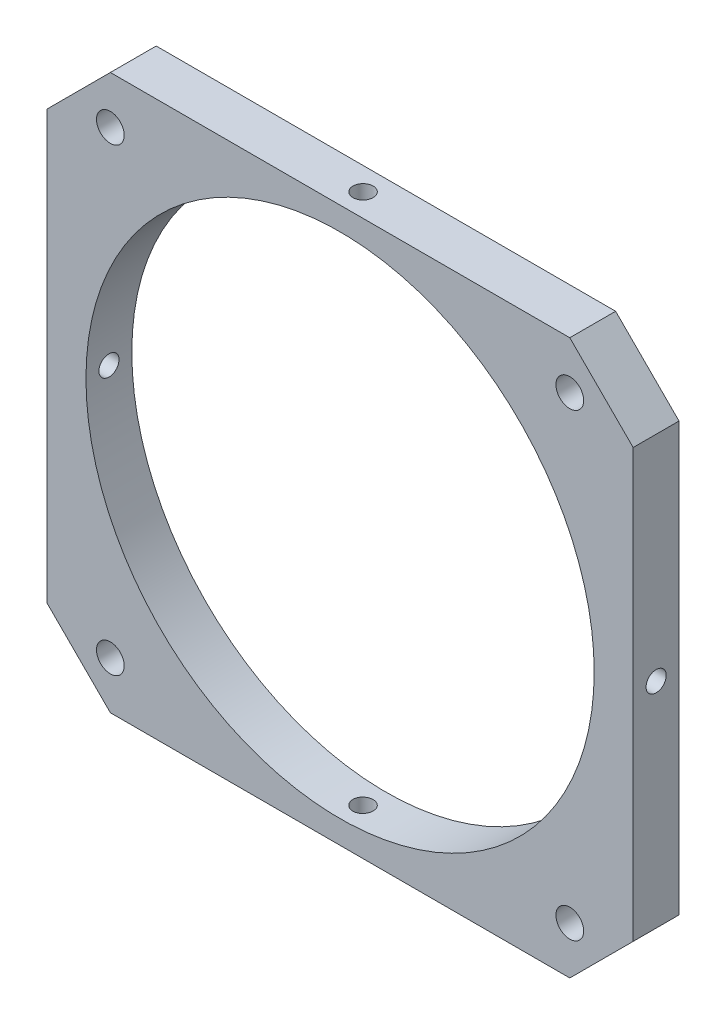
ISO-10303-21;
HEADER;
FILE_DESCRIPTION(('STEP AP214'),'2;1');
FILE_NAME('part.step','',(''),(''),'','','');
FILE_SCHEMA(('AUTOMOTIVE_DESIGN { 1 0 10303 214 1 1 1 1 }'));
ENDSEC;
DATA;
#1=APPLICATION_CONTEXT('core data for automotive mechanical design processes');
#2=APPLICATION_PROTOCOL_DEFINITION('international standard','automotive_design',2000,#1);
#3=PRODUCT_CONTEXT('',#1,'mechanical');
#4=PRODUCT('Part','Part','',(#3));
#5=PRODUCT_RELATED_PRODUCT_CATEGORY('part','',(#4));
#6=PRODUCT_DEFINITION_FORMATION('','',#4);
#7=PRODUCT_DEFINITION_CONTEXT('part definition',#1,'design');
#8=PRODUCT_DEFINITION('design','',#6,#7);
#9=PRODUCT_DEFINITION_SHAPE('','',#8);
#10=(LENGTH_UNIT() NAMED_UNIT(*) SI_UNIT(.MILLI.,.METRE.));
#11=(NAMED_UNIT(*) PLANE_ANGLE_UNIT() SI_UNIT($,.RADIAN.));
#12=(NAMED_UNIT(*) SI_UNIT($,.STERADIAN.) SOLID_ANGLE_UNIT());
#13=UNCERTAINTY_MEASURE_WITH_UNIT(LENGTH_MEASURE(1.E-05),#10,'distance_accuracy_value','');
#14=(GEOMETRIC_REPRESENTATION_CONTEXT(3) GLOBAL_UNCERTAINTY_ASSIGNED_CONTEXT((#13)) GLOBAL_UNIT_ASSIGNED_CONTEXT((#10,
#11,#12)) REPRESENTATION_CONTEXT('',''));
#15=CARTESIAN_POINT('',(0.,0.,0.));
#16=DIRECTION('',(0.,0.,1.));
#17=DIRECTION('',(1.,0.,0.));
#18=AXIS2_PLACEMENT_3D('',#15,#16,#17);
#19=CARTESIAN_POINT('',(-46.0375,-55.5625,19.05));
#20=DIRECTION('',(0.,1.,0.));
#21=DIRECTION('',(0.,0.,1.));
#22=AXIS2_PLACEMENT_3D('',#19,#20,#21);
#23=PLANE('',#22);
#24=CARTESIAN_POINT('',(-2.64090887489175E-13,-55.5625,14.4455300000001));
#25=DIRECTION('',(0.,1.,0.));
#26=DIRECTION('',(0.,0.,1.));
#27=AXIS2_PLACEMENT_3D('',#24,#25,#26);
#28=CIRCLE('',#27,2.01929999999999);
#29=CARTESIAN_POINT('',(-2.64090887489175E-13,-55.5625,16.4648300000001));
#30=VERTEX_POINT('',#29);
#31=EDGE_CURVE('E261',#30,#30,#28,.T.);
#32=ORIENTED_EDGE('',*,*,#31,.T.);
#33=EDGE_LOOP('',(#32));
#34=FACE_BOUND('',#33,.T.);
#35=DIRECTION('',(0.,0.,-1.));
#36=VECTOR('',#35,1.);
#37=CARTESIAN_POINT('',(-46.0375,-55.5625,19.05));
#38=LINE('',#37,#36);
#39=CARTESIAN_POINT('',(-46.0375,-55.5625,19.05));
#40=VERTEX_POINT('',#39);
#41=CARTESIAN_POINT('',(-46.0375,-55.5625,9.86155));
#42=VERTEX_POINT('',#41);
#43=EDGE_CURVE('E11',#40,#42,#38,.T.);
#44=ORIENTED_EDGE('',*,*,#43,.T.);
#45=DIRECTION('',(-1.,0.,0.));
#46=VECTOR('',#45,1.);
#47=CARTESIAN_POINT('',(46.0375,-55.5625,9.86155));
#48=LINE('',#47,#46);
#49=CARTESIAN_POINT('',(46.0375,-55.5625,9.86155));
#50=VERTEX_POINT('',#49);
#51=EDGE_CURVE('E152',#50,#42,#48,.T.);
#52=ORIENTED_EDGE('',*,*,#51,.F.);
#53=DIRECTION('',(0.,0.,-1.));
#54=VECTOR('',#53,1.);
#55=CARTESIAN_POINT('',(46.0375,-55.5625,19.05));
#56=LINE('',#55,#54);
#57=CARTESIAN_POINT('',(46.0375,-55.5625,19.05));
#58=VERTEX_POINT('',#57);
#59=EDGE_CURVE('E57',#58,#50,#56,.T.);
#60=ORIENTED_EDGE('',*,*,#59,.F.);
#61=DIRECTION('',(1.,0.,0.));
#62=VECTOR('',#61,1.);
#63=CARTESIAN_POINT('',(-46.0375,-55.5625,19.05));
#64=LINE('',#63,#62);
#65=EDGE_CURVE('E272',#40,#58,#64,.T.);
#66=ORIENTED_EDGE('',*,*,#65,.F.);
#67=EDGE_LOOP('',(#44,#52,#60,#66));
#68=FACE_BOUND('',#67,.T.);
#69=ADVANCED_FACE('F44',(#34,#68),#23,.F.);
#70=CARTESIAN_POINT('',(58.7375,42.8625,19.05));
#71=DIRECTION('',(-1.,0.,0.));
#72=DIRECTION('',(0.,-1.,0.));
#73=AXIS2_PLACEMENT_3D('',#70,#71,#72);
#74=PLANE('',#73);
#75=CARTESIAN_POINT('',(58.7375,0.,14.4455300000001));
#76=DIRECTION('',(-1.,0.,0.));
#77=DIRECTION('',(0.,0.,1.));
#78=AXIS2_PLACEMENT_3D('',#75,#76,#77);
#79=CIRCLE('',#78,2.01929999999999);
#80=CARTESIAN_POINT('',(58.7375,0.,16.4648300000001));
#81=VERTEX_POINT('',#80);
#82=EDGE_CURVE('E264',#81,#81,#79,.T.);
#83=ORIENTED_EDGE('',*,*,#82,.T.);
#84=EDGE_LOOP('',(#83));
#85=FACE_BOUND('',#84,.T.);
#86=DIRECTION('',(0.,0.,-1.));
#87=VECTOR('',#86,1.);
#88=CARTESIAN_POINT('',(58.7375,-42.8625,19.05));
#89=LINE('',#88,#87);
#90=CARTESIAN_POINT('',(58.7375,-42.8625,19.05));
#91=VERTEX_POINT('',#90);
#92=CARTESIAN_POINT('',(58.7375,-42.8625,9.86155));
#93=VERTEX_POINT('',#92);
#94=EDGE_CURVE('E290',#91,#93,#89,.T.);
#95=ORIENTED_EDGE('',*,*,#94,.T.);
#96=DIRECTION('',(0.,-1.,0.));
#97=VECTOR('',#96,1.);
#98=CARTESIAN_POINT('',(58.7375,42.8625,9.86155));
#99=LINE('',#98,#97);
#100=CARTESIAN_POINT('',(58.7375,42.8625,9.86155));
#101=VERTEX_POINT('',#100);
#102=EDGE_CURVE('E146',#101,#93,#99,.T.);
#103=ORIENTED_EDGE('',*,*,#102,.F.);
#104=DIRECTION('',(0.,0.,-1.));
#105=VECTOR('',#104,1.);
#106=CARTESIAN_POINT('',(58.7375,42.8625,19.05));
#107=LINE('',#106,#105);
#108=CARTESIAN_POINT('',(58.7375,42.8625,19.05));
#109=VERTEX_POINT('',#108);
#110=EDGE_CURVE('E288',#109,#101,#107,.T.);
#111=ORIENTED_EDGE('',*,*,#110,.F.);
#112=DIRECTION('',(0.,1.,0.));
#113=VECTOR('',#112,1.);
#114=CARTESIAN_POINT('',(58.7375,42.8625,19.05));
#115=LINE('',#114,#113);
#116=EDGE_CURVE('E276',#91,#109,#115,.T.);
#117=ORIENTED_EDGE('',*,*,#116,.F.);
#118=EDGE_LOOP('',(#95,#103,#111,#117));
#119=FACE_BOUND('',#118,.T.);
#120=ADVANCED_FACE('F211',(#85,#119),#74,.F.);
#121=CARTESIAN_POINT('',(-46.0375,55.5625,19.05));
#122=DIRECTION('',(0.,-1.,0.));
#123=DIRECTION('',(0.,0.,-1.));
#124=AXIS2_PLACEMENT_3D('',#121,#122,#123);
#125=PLANE('',#124);
#126=CARTESIAN_POINT('',(6.52081751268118E-13,55.5625,14.4455300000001));
#127=DIRECTION('',(0.,-1.,0.));
#128=DIRECTION('',(0.,0.,-1.));
#129=AXIS2_PLACEMENT_3D('',#126,#127,#128);
#130=CIRCLE('',#129,2.01929999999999);
#131=CARTESIAN_POINT('',(6.52081751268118E-13,55.5625,12.4262300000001));
#132=VERTEX_POINT('',#131);
#133=EDGE_CURVE('E177',#132,#132,#130,.T.);
#134=ORIENTED_EDGE('',*,*,#133,.T.);
#135=EDGE_LOOP('',(#134));
#136=FACE_BOUND('',#135,.T.);
#137=DIRECTION('',(0.,0.,-1.));
#138=VECTOR('',#137,1.);
#139=CARTESIAN_POINT('',(46.0375,55.5625,19.05));
#140=LINE('',#139,#138);
#141=CARTESIAN_POINT('',(46.0375,55.5625,19.05));
#142=VERTEX_POINT('',#141);
#143=CARTESIAN_POINT('',(46.0375,55.5625,9.86155));
#144=VERTEX_POINT('',#143);
#145=EDGE_CURVE('E120',#142,#144,#140,.T.);
#146=ORIENTED_EDGE('',*,*,#145,.T.);
#147=DIRECTION('',(1.,0.,0.));
#148=VECTOR('',#147,1.);
#149=CARTESIAN_POINT('',(-46.0375,55.5625,9.86155));
#150=LINE('',#149,#148);
#151=CARTESIAN_POINT('',(-46.0375,55.5625,9.86155));
#152=VERTEX_POINT('',#151);
#153=EDGE_CURVE('E124',#152,#144,#150,.T.);
#154=ORIENTED_EDGE('',*,*,#153,.F.);
#155=DIRECTION('',(0.,0.,-1.));
#156=VECTOR('',#155,1.);
#157=CARTESIAN_POINT('',(-46.0375,55.5625,19.05));
#158=LINE('',#157,#156);
#159=CARTESIAN_POINT('',(-46.0375,55.5625,19.05));
#160=VERTEX_POINT('',#159);
#161=EDGE_CURVE('E113',#160,#152,#158,.T.);
#162=ORIENTED_EDGE('',*,*,#161,.F.);
#163=DIRECTION('',(-1.,0.,0.));
#164=VECTOR('',#163,1.);
#165=CARTESIAN_POINT('',(-46.0375,55.5625,19.05));
#166=LINE('',#165,#164);
#167=EDGE_CURVE('E280',#142,#160,#166,.T.);
#168=ORIENTED_EDGE('',*,*,#167,.F.);
#169=EDGE_LOOP('',(#146,#154,#162,#168));
#170=FACE_BOUND('',#169,.T.);
#171=ADVANCED_FACE('F125',(#136,#170),#125,.F.);
#172=CARTESIAN_POINT('',(-58.7375,42.8625,19.05));
#173=DIRECTION('',(1.,0.,0.));
#174=DIRECTION('',(0.,1.,0.));
#175=AXIS2_PLACEMENT_3D('',#172,#173,#174);
#176=PLANE('',#175);
#177=CARTESIAN_POINT('',(-58.7375,0.,14.4455300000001));
#178=DIRECTION('',(1.,0.,0.));
#179=DIRECTION('',(0.,0.,1.));
#180=AXIS2_PLACEMENT_3D('',#177,#178,#179);
#181=CIRCLE('',#180,2.01929999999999);
#182=CARTESIAN_POINT('',(-58.7375,0.,16.4648300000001));
#183=VERTEX_POINT('',#182);
#184=EDGE_CURVE('E262',#183,#183,#181,.T.);
#185=ORIENTED_EDGE('',*,*,#184,.T.);
#186=EDGE_LOOP('',(#185));
#187=FACE_BOUND('',#186,.T.);
#188=DIRECTION('',(0.,0.,-1.));
#189=VECTOR('',#188,1.);
#190=CARTESIAN_POINT('',(-58.7375,42.8625,19.05));
#191=LINE('',#190,#189);
#192=CARTESIAN_POINT('',(-58.7375,42.8625,19.05));
#193=VERTEX_POINT('',#192);
#194=CARTESIAN_POINT('',(-58.7375,42.8625,9.86155));
#195=VERTEX_POINT('',#194);
#196=EDGE_CURVE('E121',#193,#195,#191,.T.);
#197=ORIENTED_EDGE('',*,*,#196,.T.);
#198=DIRECTION('',(0.,1.,0.));
#199=VECTOR('',#198,1.);
#200=CARTESIAN_POINT('',(-58.7375,-42.8625,9.86155));
#201=LINE('',#200,#199);
#202=CARTESIAN_POINT('',(-58.7375,-42.8625,9.86155));
#203=VERTEX_POINT('',#202);
#204=EDGE_CURVE('E137',#203,#195,#201,.T.);
#205=ORIENTED_EDGE('',*,*,#204,.F.);
#206=DIRECTION('',(0.,0.,-1.));
#207=VECTOR('',#206,1.);
#208=CARTESIAN_POINT('',(-58.7375,-42.8625,19.05));
#209=LINE('',#208,#207);
#210=CARTESIAN_POINT('',(-58.7375,-42.8625,19.05));
#211=VERTEX_POINT('',#210);
#212=EDGE_CURVE('E284',#211,#203,#209,.T.);
#213=ORIENTED_EDGE('',*,*,#212,.F.);
#214=DIRECTION('',(0.,-1.,0.));
#215=VECTOR('',#214,1.);
#216=CARTESIAN_POINT('',(-58.7375,42.8625,19.05));
#217=LINE('',#216,#215);
#218=EDGE_CURVE('E64',#193,#211,#217,.T.);
#219=ORIENTED_EDGE('',*,*,#218,.F.);
#220=EDGE_LOOP('',(#197,#205,#213,#219));
#221=FACE_BOUND('',#220,.T.);
#222=ADVANCED_FACE('F231',(#187,#221),#176,.F.);
#223=CARTESIAN_POINT('',(0.,0.,19.05));
#224=DIRECTION('',(0.,0.,-1.));
#225=DIRECTION('',(-1.,0.,0.));
#226=AXIS2_PLACEMENT_3D('',#223,#224,#225);
#227=CYLINDRICAL_SURFACE('',#226,50.927);
#228=CARTESIAN_POINT('',(0.,0.,19.05));
#229=DIRECTION('',(0.,0.,1.));
#230=DIRECTION('',(1.,0.,0.));
#231=AXIS2_PLACEMENT_3D('',#228,#229,#230);
#232=CIRCLE('',#231,50.927);
#233=CARTESIAN_POINT('',(50.927,0.,19.05));
#234=VERTEX_POINT('',#233);
#235=EDGE_CURVE('E267',#234,#234,#232,.T.);
#236=ORIENTED_EDGE('',*,*,#235,.T.);
#237=EDGE_LOOP('',(#236));
#238=FACE_BOUND('',#237,.T.);
#239=CARTESIAN_POINT('',(50.927,0.,16.4648300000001));
#240=CARTESIAN_POINT('',(50.9269994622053,0.113377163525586,16.4648249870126));
#241=CARTESIAN_POINT('',(50.9266173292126,0.226835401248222,16.4552492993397));
#242=CARTESIAN_POINT('',(50.925129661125,0.450623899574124,16.4171846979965));
#243=CARTESIAN_POINT('',(50.924023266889,0.560950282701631,16.3886733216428));
#244=CARTESIAN_POINT('',(50.9212123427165,0.775200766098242,16.3135532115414));
#245=CARTESIAN_POINT('',(50.9195081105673,0.879128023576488,16.2669534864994));
#246=CARTESIAN_POINT('',(50.91569361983,1.07765620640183,16.1569927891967));
#247=CARTESIAN_POINT('',(50.9135834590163,1.17225936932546,16.0936358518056));
#248=CARTESIAN_POINT('',(50.9091929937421,1.3495478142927,15.9519096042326));
#249=CARTESIAN_POINT('',(50.9069125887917,1.43222597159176,15.8735313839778));
#250=CARTESIAN_POINT('',(50.9024395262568,1.58325706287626,15.7040043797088));
#251=CARTESIAN_POINT('',(50.9002468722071,1.65160942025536,15.6128550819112));
#252=CARTESIAN_POINT('',(50.8961959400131,1.7720650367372,15.4203401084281));
#253=CARTESIAN_POINT('',(50.894337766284,1.82416322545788,15.3189712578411));
#254=CARTESIAN_POINT('',(50.8911664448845,1.91059894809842,15.1089171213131));
#255=CARTESIAN_POINT('',(50.8898532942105,1.94493657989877,15.0002318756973));
#256=CARTESIAN_POINT('',(50.8879209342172,1.99485898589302,14.7786912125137));
#257=CARTESIAN_POINT('',(50.8873013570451,2.01045370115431,14.6658380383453));
#258=CARTESIAN_POINT('',(50.886824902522,2.02247824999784,14.4391140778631));
#259=CARTESIAN_POINT('',(50.8869680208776,2.01890819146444,14.3252432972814));
#260=CARTESIAN_POINT('',(50.8880004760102,1.99271286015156,14.099783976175));
#261=CARTESIAN_POINT('',(50.8888893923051,1.97009832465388,13.9881941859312));
#262=CARTESIAN_POINT('',(50.8913125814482,1.90647260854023,13.7703960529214));
#263=CARTESIAN_POINT('',(50.8928468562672,1.86546137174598,13.66418772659));
#264=CARTESIAN_POINT('',(50.89638830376,1.76619410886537,13.4601327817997));
#265=CARTESIAN_POINT('',(50.8983956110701,1.7079331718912,13.3622885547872));
#266=CARTESIAN_POINT('',(50.902656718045,1.57582392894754,13.17776543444));
#267=CARTESIAN_POINT('',(50.9049105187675,1.50197555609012,13.0910865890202));
#268=CARTESIAN_POINT('',(50.9094124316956,1.34072705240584,12.931292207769));
#269=CARTESIAN_POINT('',(50.9116605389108,1.25331761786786,12.8581860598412));
#270=CARTESIAN_POINT('',(50.9158961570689,1.06746098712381,12.7276845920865));
#271=CARTESIAN_POINT('',(50.9178836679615,0.969013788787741,12.6702892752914));
#272=CARTESIAN_POINT('',(50.9213741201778,0.763870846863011,12.572839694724));
#273=CARTESIAN_POINT('',(50.9228770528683,0.657174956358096,12.5327857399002));
#274=CARTESIAN_POINT('',(50.9252288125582,0.438565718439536,12.4711619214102));
#275=CARTESIAN_POINT('',(50.9260776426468,0.326652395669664,12.4495919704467));
#276=CARTESIAN_POINT('',(50.9270251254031,0.100866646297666,12.4255599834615));
#277=CARTESIAN_POINT('',(50.9271242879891,-0.013004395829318,12.4230849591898));
#278=CARTESIAN_POINT('',(50.9265626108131,-0.239544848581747,12.4372792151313));
#279=CARTESIAN_POINT('',(50.9259017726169,-0.352214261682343,12.453948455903));
#280=CARTESIAN_POINT('',(50.9238948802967,-0.57311689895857,12.5059473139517));
#281=CARTESIAN_POINT('',(50.9225490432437,-0.681351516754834,12.5412710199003));
#282=CARTESIAN_POINT('',(50.9193237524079,-0.890355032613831,12.6295701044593));
#283=CARTESIAN_POINT('',(50.9174442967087,-0.991123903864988,12.6825455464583));
#284=CARTESIAN_POINT('',(50.9133620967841,-1.18239519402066,12.8046776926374));
#285=CARTESIAN_POINT('',(50.9111591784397,-1.27289203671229,12.8738431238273));
#286=CARTESIAN_POINT('',(50.9066788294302,-1.44099436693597,13.026379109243));
#287=CARTESIAN_POINT('',(50.9044013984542,-1.51859980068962,13.109749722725));
#288=CARTESIAN_POINT('',(50.9000272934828,-1.6587599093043,13.2883852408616));
#289=CARTESIAN_POINT('',(50.8979307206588,-1.72130619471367,13.3836567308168));
#290=CARTESIAN_POINT('',(50.8941563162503,-1.82951521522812,13.5833561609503));
#291=CARTESIAN_POINT('',(50.8924784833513,-1.87517800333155,13.6877840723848));
#292=CARTESIAN_POINT('',(50.8897314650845,-1.94830914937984,13.9028006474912));
#293=CARTESIAN_POINT('',(50.8886620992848,-1.97578290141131,14.0133874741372));
#294=CARTESIAN_POINT('',(50.8872520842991,-2.01177375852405,14.2376085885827));
#295=CARTESIAN_POINT('',(50.8869114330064,-2.02029091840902,14.3512428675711));
#296=CARTESIAN_POINT('',(50.8869973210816,-2.01812621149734,14.5782495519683));
#297=CARTESIAN_POINT('',(50.887423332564,-2.00745755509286,14.6916220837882));
#298=CARTESIAN_POINT('',(50.8889934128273,-1.96725130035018,14.9149653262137));
#299=CARTESIAN_POINT('',(50.8901374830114,-1.93771366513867,15.0249360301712));
#300=CARTESIAN_POINT('',(50.8930146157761,-1.8606102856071,15.2383575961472));
#301=CARTESIAN_POINT('',(50.894747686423,-1.81304429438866,15.3418083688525));
#302=CARTESIAN_POINT('',(50.8986073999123,-1.70123746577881,15.5392550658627));
#303=CARTESIAN_POINT('',(50.9007340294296,-1.6369971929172,15.6332513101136));
#304=CARTESIAN_POINT('',(50.9051427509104,-1.49362079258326,15.8091849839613));
#305=CARTESIAN_POINT('',(50.9074249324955,-1.41447603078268,15.891115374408));
#306=CARTESIAN_POINT('',(50.9118871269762,-1.243532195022,16.0405501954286));
#307=CARTESIAN_POINT('',(50.914067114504,-1.15173000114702,16.1080510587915));
#308=CARTESIAN_POINT('',(50.9180802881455,-0.958026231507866,16.2267305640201));
#309=CARTESIAN_POINT('',(50.9199132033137,-0.856116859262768,16.277896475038));
#310=CARTESIAN_POINT('',(50.9230212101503,-0.645224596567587,16.362331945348));
#311=CARTESIAN_POINT('',(50.9242969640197,-0.536250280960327,16.3956227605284));
#312=CARTESIAN_POINT('',(50.925807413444,-0.355493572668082,16.4345784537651));
#313=CARTESIAN_POINT('',(50.9262526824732,-0.284883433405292,16.4459084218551));
#314=CARTESIAN_POINT('',(50.9268491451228,-0.142859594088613,16.4610357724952));
#315=CARTESIAN_POINT('',(50.9270003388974,-0.0714458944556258,16.4648331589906));
#316=CARTESIAN_POINT('',(50.927,0.,16.4648300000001));
#317=B_SPLINE_CURVE_WITH_KNOTS('',3,(#239,#240,#241,#242,#243,#244,#245,#246,#247,#248,#249,
#250,#251,#252,#253,#254,#255,#256,#257,#258,#259,#260,#261,#262,#263,#264,#265,#266,#267,#268,
#269,#270,#271,#272,#273,#274,#275,#276,#277,#278,#279,#280,#281,#282,#283,#284,#285,#286,#287,
#288,#289,#290,#291,#292,#293,#294,#295,#296,#297,#298,#299,#300,#301,#302,#303,#304,#305,#306,
#307,#308,#309,#310,#311,#312,#313,#314,#315,#316),.UNSPECIFIED.,.T.,.F.,(4,2,2,2,2,2,2,2,2,2,2,
2,2,2,2,2,2,2,2,2,2,2,2,2,2,2,2,2,2,2,2,2,2,2,2,2,2,2,4),(0.,0.33987069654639,0.680145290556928,
1.02025063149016,1.36027415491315,1.70049999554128,2.04073952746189,2.38108508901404,
2.7214287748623,3.06159186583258,3.40175304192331,3.74172256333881,4.08169312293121,
4.42176056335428,4.76182946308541,5.1021327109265,5.44243602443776,5.78274540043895,
6.12305316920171,6.46312944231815,6.80320501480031,7.14317288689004,7.48314197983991,
7.82329475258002,8.16344894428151,8.50379219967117,8.84413438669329,9.18437559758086,
9.52461582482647,9.86462186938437,10.2046285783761,10.5446399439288,10.8846397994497,
11.2248372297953,11.5651186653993,11.9056646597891,12.2458047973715,12.4599782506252,
12.674151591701),.UNSPECIFIED.);
#318=CARTESIAN_POINT('',(50.927,0.,16.4648300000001));
#319=VERTEX_POINT('',#318);
#320=EDGE_CURVE('E48',#319,#319,#317,.T.);
#321=ORIENTED_EDGE('',*,*,#320,.F.);
#322=EDGE_LOOP('',(#321));
#323=FACE_BOUND('',#322,.T.);
#324=CARTESIAN_POINT('',(-2.47906125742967E-13,-50.927,16.4648300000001));
#325=CARTESIAN_POINT('',(0.113377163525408,-50.9269994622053,16.4648249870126));
#326=CARTESIAN_POINT('',(0.226835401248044,-50.9266173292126,16.4552492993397));
#327=CARTESIAN_POINT('',(0.450623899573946,-50.925129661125,16.4171846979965));
#328=CARTESIAN_POINT('',(0.560950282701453,-50.924023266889,16.3886733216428));
#329=CARTESIAN_POINT('',(0.775200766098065,-50.9212123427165,16.3135532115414));
#330=CARTESIAN_POINT('',(0.87912802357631,-50.9195081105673,16.2669534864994));
#331=CARTESIAN_POINT('',(1.07765620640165,-50.91569361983,16.1569927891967));
#332=CARTESIAN_POINT('',(1.17225936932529,-50.9135834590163,16.0936358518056));
#333=CARTESIAN_POINT('',(1.34954781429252,-50.9091929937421,15.9519096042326));
#334=CARTESIAN_POINT('',(1.43222597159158,-50.9069125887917,15.8735313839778));
#335=CARTESIAN_POINT('',(1.58325706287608,-50.9024395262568,15.7040043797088));
#336=CARTESIAN_POINT('',(1.65160942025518,-50.9002468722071,15.6128550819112));
#337=CARTESIAN_POINT('',(1.77206503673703,-50.8961959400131,15.4203401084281));
#338=CARTESIAN_POINT('',(1.82416322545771,-50.894337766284,15.3189712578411));
#339=CARTESIAN_POINT('',(1.91059894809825,-50.8911664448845,15.1089171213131));
#340=CARTESIAN_POINT('',(1.9449365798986,-50.8898532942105,15.0002318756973));
#341=CARTESIAN_POINT('',(1.99485898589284,-50.8879209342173,14.7786912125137));
#342=CARTESIAN_POINT('',(2.01045370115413,-50.8873013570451,14.6658380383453));
#343=CARTESIAN_POINT('',(2.02247824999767,-50.886824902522,14.4391140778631));
#344=CARTESIAN_POINT('',(2.01890819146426,-50.8869680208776,14.3252432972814));
#345=CARTESIAN_POINT('',(1.99271286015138,-50.8880004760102,14.099783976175));
#346=CARTESIAN_POINT('',(1.9700983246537,-50.8888893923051,13.9881941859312));
#347=CARTESIAN_POINT('',(1.90647260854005,-50.8913125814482,13.7703960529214));
#348=CARTESIAN_POINT('',(1.8654613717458,-50.8928468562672,13.66418772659));
#349=CARTESIAN_POINT('',(1.76619410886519,-50.89638830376,13.4601327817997));
#350=CARTESIAN_POINT('',(1.70793317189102,-50.8983956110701,13.3622885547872));
#351=CARTESIAN_POINT('',(1.57582392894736,-50.902656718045,13.17776543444));
#352=CARTESIAN_POINT('',(1.50197555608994,-50.9049105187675,13.0910865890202));
#353=CARTESIAN_POINT('',(1.34072705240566,-50.9094124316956,12.931292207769));
#354=CARTESIAN_POINT('',(1.25331761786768,-50.9116605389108,12.8581860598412));
#355=CARTESIAN_POINT('',(1.06746098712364,-50.9158961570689,12.7276845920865));
#356=CARTESIAN_POINT('',(0.969013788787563,-50.9178836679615,12.6702892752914));
#357=CARTESIAN_POINT('',(0.763870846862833,-50.9213741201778,12.572839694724));
#358=CARTESIAN_POINT('',(0.657174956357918,-50.9228770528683,12.5327857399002));
#359=CARTESIAN_POINT('',(0.438565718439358,-50.9252288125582,12.4711619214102));
#360=CARTESIAN_POINT('',(0.326652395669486,-50.9260776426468,12.4495919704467));
#361=CARTESIAN_POINT('',(0.100866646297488,-50.9270251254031,12.4255599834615));
#362=CARTESIAN_POINT('',(-0.0130043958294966,-50.9271242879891,12.4230849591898));
#363=CARTESIAN_POINT('',(-0.239544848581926,-50.9265626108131,12.4372792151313));
#364=CARTESIAN_POINT('',(-0.352214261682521,-50.9259017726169,12.453948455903));
#365=CARTESIAN_POINT('',(-0.573116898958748,-50.9238948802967,12.5059473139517));
#366=CARTESIAN_POINT('',(-0.681351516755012,-50.9225490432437,12.5412710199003));
#367=CARTESIAN_POINT('',(-0.890355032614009,-50.9193237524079,12.6295701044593));
#368=CARTESIAN_POINT('',(-0.991123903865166,-50.9174442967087,12.6825455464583));
#369=CARTESIAN_POINT('',(-1.18239519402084,-50.9133620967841,12.8046776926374));
#370=CARTESIAN_POINT('',(-1.27289203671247,-50.9111591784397,12.8738431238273));
#371=CARTESIAN_POINT('',(-1.44099436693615,-50.9066788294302,13.026379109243));
#372=CARTESIAN_POINT('',(-1.5185998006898,-50.9044013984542,13.109749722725));
#373=CARTESIAN_POINT('',(-1.65875990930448,-50.9000272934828,13.2883852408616));
#374=CARTESIAN_POINT('',(-1.72130619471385,-50.8979307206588,13.3836567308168));
#375=CARTESIAN_POINT('',(-1.8295152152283,-50.8941563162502,13.5833561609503));
#376=CARTESIAN_POINT('',(-1.87517800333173,-50.8924784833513,13.6877840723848));
#377=CARTESIAN_POINT('',(-1.94830914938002,-50.8897314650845,13.9028006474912));
#378=CARTESIAN_POINT('',(-1.97578290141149,-50.8886620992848,14.0133874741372));
#379=CARTESIAN_POINT('',(-2.01177375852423,-50.8872520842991,14.2376085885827));
#380=CARTESIAN_POINT('',(-2.02029091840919,-50.8869114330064,14.3512428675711));
#381=CARTESIAN_POINT('',(-2.01812621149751,-50.8869973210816,14.5782495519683));
#382=CARTESIAN_POINT('',(-2.00745755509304,-50.887423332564,14.6916220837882));
#383=CARTESIAN_POINT('',(-1.96725130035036,-50.8889934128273,14.9149653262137));
#384=CARTESIAN_POINT('',(-1.93771366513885,-50.8901374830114,15.0249360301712));
#385=CARTESIAN_POINT('',(-1.86061028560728,-50.8930146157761,15.2383575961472));
#386=CARTESIAN_POINT('',(-1.81304429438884,-50.8947476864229,15.3418083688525));
#387=CARTESIAN_POINT('',(-1.70123746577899,-50.8986073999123,15.5392550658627));
#388=CARTESIAN_POINT('',(-1.63699719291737,-50.9007340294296,15.6332513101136));
#389=CARTESIAN_POINT('',(-1.49362079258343,-50.9051427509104,15.8091849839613));
#390=CARTESIAN_POINT('',(-1.41447603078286,-50.9074249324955,15.891115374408));
#391=CARTESIAN_POINT('',(-1.24353219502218,-50.9118871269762,16.0405501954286));
#392=CARTESIAN_POINT('',(-1.1517300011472,-50.914067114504,16.1080510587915));
#393=CARTESIAN_POINT('',(-0.958026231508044,-50.9180802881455,16.2267305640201));
#394=CARTESIAN_POINT('',(-0.856116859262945,-50.9199132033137,16.277896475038));
#395=CARTESIAN_POINT('',(-0.645224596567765,-50.9230212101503,16.362331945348));
#396=CARTESIAN_POINT('',(-0.536250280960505,-50.9242969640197,16.3956227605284));
#397=CARTESIAN_POINT('',(-0.35549357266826,-50.925807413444,16.4345784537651));
#398=CARTESIAN_POINT('',(-0.28488343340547,-50.9262526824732,16.4459084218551));
#399=CARTESIAN_POINT('',(-0.142859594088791,-50.9268491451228,16.4610357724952));
#400=CARTESIAN_POINT('',(-0.0714458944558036,-50.9270003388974,16.4648331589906));
#401=CARTESIAN_POINT('',(-2.47906125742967E-13,-50.927,16.4648300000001));
#402=B_SPLINE_CURVE_WITH_KNOTS('',3,(#324,#325,#326,#327,#328,#329,#330,#331,#332,#333,#334,
#335,#336,#337,#338,#339,#340,#341,#342,#343,#344,#345,#346,#347,#348,#349,#350,#351,#352,#353,
#354,#355,#356,#357,#358,#359,#360,#361,#362,#363,#364,#365,#366,#367,#368,#369,#370,#371,#372,
#373,#374,#375,#376,#377,#378,#379,#380,#381,#382,#383,#384,#385,#386,#387,#388,#389,#390,#391,
#392,#393,#394,#395,#396,#397,#398,#399,#400,#401),.UNSPECIFIED.,.T.,.F.,(4,2,2,2,2,2,2,2,2,2,2,
2,2,2,2,2,2,2,2,2,2,2,2,2,2,2,2,2,2,2,2,2,2,2,2,2,2,2,4),(0.,0.33987069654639,0.680145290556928,
1.02025063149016,1.36027415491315,1.70049999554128,2.04073952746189,2.38108508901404,
2.7214287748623,3.06159186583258,3.40175304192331,3.74172256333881,4.08169312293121,
4.42176056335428,4.76182946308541,5.1021327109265,5.44243602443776,5.78274540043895,
6.12305316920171,6.46312944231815,6.80320501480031,7.14317288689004,7.4831419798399,
7.82329475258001,8.16344894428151,8.50379219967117,8.84413438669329,9.18437559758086,
9.52461582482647,9.86462186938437,10.2046285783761,10.5446399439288,10.8846397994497,
11.2248372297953,11.5651186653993,11.9056646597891,12.2458047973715,12.4599782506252,
12.674151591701),.UNSPECIFIED.);
#403=CARTESIAN_POINT('',(-2.47906125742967E-13,-50.927,16.4648300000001));
#404=VERTEX_POINT('',#403);
#405=EDGE_CURVE('E255',#404,#404,#402,.T.);
#406=ORIENTED_EDGE('',*,*,#405,.F.);
#407=EDGE_LOOP('',(#406));
#408=FACE_BOUND('',#407,.T.);
#409=CARTESIAN_POINT('',(-50.927,0.,16.4648300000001));
#410=CARTESIAN_POINT('',(-50.9269994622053,-0.113377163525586,16.4648249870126));
#411=CARTESIAN_POINT('',(-50.9266173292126,-0.226835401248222,16.4552492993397));
#412=CARTESIAN_POINT('',(-50.925129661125,-0.450623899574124,16.4171846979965));
#413=CARTESIAN_POINT('',(-50.924023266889,-0.560950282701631,16.3886733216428));
#414=CARTESIAN_POINT('',(-50.9212123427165,-0.775200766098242,16.3135532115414));
#415=CARTESIAN_POINT('',(-50.9195081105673,-0.879128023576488,16.2669534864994));
#416=CARTESIAN_POINT('',(-50.91569361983,-1.07765620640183,16.1569927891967));
#417=CARTESIAN_POINT('',(-50.9135834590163,-1.17225936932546,16.0936358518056));
#418=CARTESIAN_POINT('',(-50.9091929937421,-1.3495478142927,15.9519096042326));
#419=CARTESIAN_POINT('',(-50.9069125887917,-1.43222597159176,15.8735313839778));
#420=CARTESIAN_POINT('',(-50.9024395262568,-1.58325706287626,15.7040043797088));
#421=CARTESIAN_POINT('',(-50.9002468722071,-1.65160942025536,15.6128550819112));
#422=CARTESIAN_POINT('',(-50.8961959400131,-1.7720650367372,15.4203401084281));
#423=CARTESIAN_POINT('',(-50.894337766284,-1.82416322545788,15.3189712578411));
#424=CARTESIAN_POINT('',(-50.8911664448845,-1.91059894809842,15.1089171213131));
#425=CARTESIAN_POINT('',(-50.8898532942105,-1.94493657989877,15.0002318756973));
#426=CARTESIAN_POINT('',(-50.8879209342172,-1.99485898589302,14.7786912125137));
#427=CARTESIAN_POINT('',(-50.8873013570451,-2.01045370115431,14.6658380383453));
#428=CARTESIAN_POINT('',(-50.886824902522,-2.02247824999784,14.4391140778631));
#429=CARTESIAN_POINT('',(-50.8869680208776,-2.01890819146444,14.3252432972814));
#430=CARTESIAN_POINT('',(-50.8880004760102,-1.99271286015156,14.099783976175));
#431=CARTESIAN_POINT('',(-50.8888893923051,-1.97009832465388,13.9881941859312));
#432=CARTESIAN_POINT('',(-50.8913125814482,-1.90647260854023,13.7703960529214));
#433=CARTESIAN_POINT('',(-50.8928468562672,-1.86546137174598,13.66418772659));
#434=CARTESIAN_POINT('',(-50.89638830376,-1.76619410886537,13.4601327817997));
#435=CARTESIAN_POINT('',(-50.8983956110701,-1.7079331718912,13.3622885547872));
#436=CARTESIAN_POINT('',(-50.902656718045,-1.57582392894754,13.17776543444));
#437=CARTESIAN_POINT('',(-50.9049105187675,-1.50197555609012,13.0910865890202));
#438=CARTESIAN_POINT('',(-50.9094124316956,-1.34072705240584,12.931292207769));
#439=CARTESIAN_POINT('',(-50.9116605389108,-1.25331761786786,12.8581860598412));
#440=CARTESIAN_POINT('',(-50.9158961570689,-1.06746098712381,12.7276845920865));
#441=CARTESIAN_POINT('',(-50.9178836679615,-0.969013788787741,12.6702892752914));
#442=CARTESIAN_POINT('',(-50.9213741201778,-0.763870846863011,12.572839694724));
#443=CARTESIAN_POINT('',(-50.9228770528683,-0.657174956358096,12.5327857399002));
#444=CARTESIAN_POINT('',(-50.9252288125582,-0.438565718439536,12.4711619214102));
#445=CARTESIAN_POINT('',(-50.9260776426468,-0.326652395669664,12.4495919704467));
#446=CARTESIAN_POINT('',(-50.9270251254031,-0.100866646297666,12.4255599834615));
#447=CARTESIAN_POINT('',(-50.9271242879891,0.013004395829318,12.4230849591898));
#448=CARTESIAN_POINT('',(-50.9265626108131,0.239544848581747,12.4372792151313));
#449=CARTESIAN_POINT('',(-50.9259017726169,0.352214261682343,12.453948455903));
#450=CARTESIAN_POINT('',(-50.9238948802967,0.57311689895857,12.5059473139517));
#451=CARTESIAN_POINT('',(-50.9225490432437,0.681351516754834,12.5412710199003));
#452=CARTESIAN_POINT('',(-50.9193237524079,0.890355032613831,12.6295701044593));
#453=CARTESIAN_POINT('',(-50.9174442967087,0.991123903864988,12.6825455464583));
#454=CARTESIAN_POINT('',(-50.9133620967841,1.18239519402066,12.8046776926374));
#455=CARTESIAN_POINT('',(-50.9111591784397,1.27289203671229,12.8738431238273));
#456=CARTESIAN_POINT('',(-50.9066788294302,1.44099436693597,13.026379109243));
#457=CARTESIAN_POINT('',(-50.9044013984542,1.51859980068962,13.109749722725));
#458=CARTESIAN_POINT('',(-50.9000272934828,1.6587599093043,13.2883852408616));
#459=CARTESIAN_POINT('',(-50.8979307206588,1.72130619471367,13.3836567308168));
#460=CARTESIAN_POINT('',(-50.8941563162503,1.82951521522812,13.5833561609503));
#461=CARTESIAN_POINT('',(-50.8924784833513,1.87517800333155,13.6877840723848));
#462=CARTESIAN_POINT('',(-50.8897314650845,1.94830914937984,13.9028006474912));
#463=CARTESIAN_POINT('',(-50.8886620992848,1.97578290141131,14.0133874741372));
#464=CARTESIAN_POINT('',(-50.8872520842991,2.01177375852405,14.2376085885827));
#465=CARTESIAN_POINT('',(-50.8869114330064,2.02029091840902,14.3512428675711));
#466=CARTESIAN_POINT('',(-50.8869973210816,2.01812621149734,14.5782495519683));
#467=CARTESIAN_POINT('',(-50.887423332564,2.00745755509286,14.6916220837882));
#468=CARTESIAN_POINT('',(-50.8889934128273,1.96725130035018,14.9149653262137));
#469=CARTESIAN_POINT('',(-50.8901374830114,1.93771366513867,15.0249360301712));
#470=CARTESIAN_POINT('',(-50.8930146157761,1.8606102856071,15.2383575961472));
#471=CARTESIAN_POINT('',(-50.894747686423,1.81304429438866,15.3418083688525));
#472=CARTESIAN_POINT('',(-50.8986073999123,1.70123746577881,15.5392550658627));
#473=CARTESIAN_POINT('',(-50.9007340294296,1.6369971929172,15.6332513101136));
#474=CARTESIAN_POINT('',(-50.9051427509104,1.49362079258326,15.8091849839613));
#475=CARTESIAN_POINT('',(-50.9074249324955,1.41447603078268,15.891115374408));
#476=CARTESIAN_POINT('',(-50.9118871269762,1.243532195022,16.0405501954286));
#477=CARTESIAN_POINT('',(-50.914067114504,1.15173000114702,16.1080510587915));
#478=CARTESIAN_POINT('',(-50.9180802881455,0.958026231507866,16.2267305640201));
#479=CARTESIAN_POINT('',(-50.9199132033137,0.856116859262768,16.277896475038));
#480=CARTESIAN_POINT('',(-50.9230212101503,0.645224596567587,16.362331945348));
#481=CARTESIAN_POINT('',(-50.9242969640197,0.536250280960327,16.3956227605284));
#482=CARTESIAN_POINT('',(-50.925807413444,0.355493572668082,16.4345784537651));
#483=CARTESIAN_POINT('',(-50.9262526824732,0.284883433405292,16.4459084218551));
#484=CARTESIAN_POINT('',(-50.9268491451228,0.142859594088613,16.4610357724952));
#485=CARTESIAN_POINT('',(-50.9270003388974,0.0714458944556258,16.4648331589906));
#486=CARTESIAN_POINT('',(-50.927,0.,16.4648300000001));
#487=B_SPLINE_CURVE_WITH_KNOTS('',3,(#409,#410,#411,#412,#413,#414,#415,#416,#417,#418,#419,
#420,#421,#422,#423,#424,#425,#426,#427,#428,#429,#430,#431,#432,#433,#434,#435,#436,#437,#438,
#439,#440,#441,#442,#443,#444,#445,#446,#447,#448,#449,#450,#451,#452,#453,#454,#455,#456,#457,
#458,#459,#460,#461,#462,#463,#464,#465,#466,#467,#468,#469,#470,#471,#472,#473,#474,#475,#476,
#477,#478,#479,#480,#481,#482,#483,#484,#485,#486),.UNSPECIFIED.,.T.,.F.,(4,2,2,2,2,2,2,2,2,2,2,
2,2,2,2,2,2,2,2,2,2,2,2,2,2,2,2,2,2,2,2,2,2,2,2,2,2,2,4),(0.,0.33987069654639,0.680145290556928,
1.02025063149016,1.36027415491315,1.70049999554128,2.04073952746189,2.38108508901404,
2.7214287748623,3.06159186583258,3.40175304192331,3.74172256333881,4.08169312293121,
4.42176056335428,4.76182946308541,5.1021327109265,5.44243602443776,5.78274540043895,
6.12305316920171,6.46312944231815,6.80320501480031,7.14317288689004,7.48314197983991,
7.82329475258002,8.16344894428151,8.50379219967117,8.84413438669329,9.18437559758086,
9.52461582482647,9.86462186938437,10.2046285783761,10.5446399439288,10.8846397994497,
11.2248372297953,11.5651186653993,11.9056646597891,12.2458047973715,12.4599782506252,
12.674151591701),.UNSPECIFIED.);
#488=CARTESIAN_POINT('',(-50.927,0.,16.4648300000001));
#489=VERTEX_POINT('',#488);
#490=EDGE_CURVE('E318',#489,#489,#487,.T.);
#491=ORIENTED_EDGE('',*,*,#490,.F.);
#492=EDGE_LOOP('',(#491));
#493=FACE_BOUND('',#492,.T.);
#494=CARTESIAN_POINT('',(6.03527466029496E-13,50.927,16.4648300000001));
#495=CARTESIAN_POINT('',(-0.113377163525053,50.9269994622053,16.4648249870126));
#496=CARTESIAN_POINT('',(-0.226835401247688,50.9266173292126,16.4552492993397));
#497=CARTESIAN_POINT('',(-0.45062389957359,50.925129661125,16.4171846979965));
#498=CARTESIAN_POINT('',(-0.560950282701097,50.924023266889,16.3886733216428));
#499=CARTESIAN_POINT('',(-0.775200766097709,50.9212123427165,16.3135532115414));
#500=CARTESIAN_POINT('',(-0.879128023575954,50.9195081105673,16.2669534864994));
#501=CARTESIAN_POINT('',(-1.0776562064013,50.91569361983,16.1569927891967));
#502=CARTESIAN_POINT('',(-1.17225936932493,50.9135834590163,16.0936358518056));
#503=CARTESIAN_POINT('',(-1.34954781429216,50.9091929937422,15.9519096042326));
#504=CARTESIAN_POINT('',(-1.43222597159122,50.9069125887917,15.8735313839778));
#505=CARTESIAN_POINT('',(-1.58325706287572,50.9024395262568,15.7040043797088));
#506=CARTESIAN_POINT('',(-1.65160942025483,50.9002468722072,15.6128550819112));
#507=CARTESIAN_POINT('',(-1.77206503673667,50.8961959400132,15.4203401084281));
#508=CARTESIAN_POINT('',(-1.82416322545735,50.894337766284,15.3189712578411));
#509=CARTESIAN_POINT('',(-1.91059894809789,50.8911664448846,15.1089171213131));
#510=CARTESIAN_POINT('',(-1.94493657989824,50.8898532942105,15.0002318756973));
#511=CARTESIAN_POINT('',(-1.99485898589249,50.8879209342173,14.7786912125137));
#512=CARTESIAN_POINT('',(-2.01045370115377,50.8873013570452,14.6658380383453));
#513=CARTESIAN_POINT('',(-2.02247824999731,50.886824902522,14.4391140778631));
#514=CARTESIAN_POINT('',(-2.0189081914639,50.8869680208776,14.3252432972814));
#515=CARTESIAN_POINT('',(-1.99271286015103,50.8880004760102,14.099783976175));
#516=CARTESIAN_POINT('',(-1.97009832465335,50.8888893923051,13.9881941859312));
#517=CARTESIAN_POINT('',(-1.9064726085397,50.8913125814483,13.7703960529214));
#518=CARTESIAN_POINT('',(-1.86546137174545,50.8928468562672,13.66418772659));
#519=CARTESIAN_POINT('',(-1.76619410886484,50.89638830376,13.4601327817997));
#520=CARTESIAN_POINT('',(-1.70793317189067,50.8983956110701,13.3622885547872));
#521=CARTESIAN_POINT('',(-1.57582392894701,50.902656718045,13.17776543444));
#522=CARTESIAN_POINT('',(-1.50197555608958,50.9049105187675,13.0910865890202));
#523=CARTESIAN_POINT('',(-1.34072705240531,50.9094124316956,12.931292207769));
#524=CARTESIAN_POINT('',(-1.25331761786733,50.9116605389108,12.8581860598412));
#525=CARTESIAN_POINT('',(-1.06746098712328,50.9158961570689,12.7276845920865));
#526=CARTESIAN_POINT('',(-0.969013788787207,50.9178836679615,12.6702892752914));
#527=CARTESIAN_POINT('',(-0.763870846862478,50.9213741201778,12.572839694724));
#528=CARTESIAN_POINT('',(-0.657174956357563,50.9228770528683,12.5327857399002));
#529=CARTESIAN_POINT('',(-0.438565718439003,50.9252288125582,12.4711619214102));
#530=CARTESIAN_POINT('',(-0.326652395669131,50.9260776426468,12.4495919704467));
#531=CARTESIAN_POINT('',(-0.100866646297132,50.9270251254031,12.4255599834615));
#532=CARTESIAN_POINT('',(0.0130043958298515,50.9271242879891,12.4230849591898));
#533=CARTESIAN_POINT('',(0.239544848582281,50.9265626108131,12.4372792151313));
#534=CARTESIAN_POINT('',(0.352214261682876,50.9259017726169,12.453948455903));
#535=CARTESIAN_POINT('',(0.573116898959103,50.9238948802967,12.5059473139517));
#536=CARTESIAN_POINT('',(0.681351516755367,50.9225490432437,12.5412710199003));
#537=CARTESIAN_POINT('',(0.890355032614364,50.9193237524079,12.6295701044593));
#538=CARTESIAN_POINT('',(0.991123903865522,50.9174442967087,12.6825455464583));
#539=CARTESIAN_POINT('',(1.18239519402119,50.9133620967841,12.8046776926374));
#540=CARTESIAN_POINT('',(1.27289203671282,50.9111591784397,12.8738431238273));
#541=CARTESIAN_POINT('',(1.4409943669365,50.9066788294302,13.026379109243));
#542=CARTESIAN_POINT('',(1.51859980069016,50.9044013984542,13.109749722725));
#543=CARTESIAN_POINT('',(1.65875990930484,50.9000272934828,13.2883852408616));
#544=CARTESIAN_POINT('',(1.7213061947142,50.8979307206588,13.3836567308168));
#545=CARTESIAN_POINT('',(1.82951521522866,50.8941563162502,13.5833561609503));
#546=CARTESIAN_POINT('',(1.87517800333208,50.8924784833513,13.6877840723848));
#547=CARTESIAN_POINT('',(1.94830914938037,50.8897314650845,13.9028006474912));
#548=CARTESIAN_POINT('',(1.97578290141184,50.8886620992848,14.0133874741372));
#549=CARTESIAN_POINT('',(2.01177375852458,50.8872520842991,14.2376085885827));
#550=CARTESIAN_POINT('',(2.02029091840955,50.8869114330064,14.3512428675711));
#551=CARTESIAN_POINT('',(2.01812621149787,50.8869973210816,14.5782495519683));
#552=CARTESIAN_POINT('',(2.00745755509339,50.887423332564,14.6916220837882));
#553=CARTESIAN_POINT('',(1.96725130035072,50.8889934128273,14.9149653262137));
#554=CARTESIAN_POINT('',(1.9377136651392,50.8901374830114,15.0249360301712));
#555=CARTESIAN_POINT('',(1.86061028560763,50.8930146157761,15.2383575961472));
#556=CARTESIAN_POINT('',(1.81304429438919,50.8947476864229,15.3418083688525));
#557=CARTESIAN_POINT('',(1.70123746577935,50.8986073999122,15.5392550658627));
#558=CARTESIAN_POINT('',(1.63699719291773,50.9007340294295,15.6332513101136));
#559=CARTESIAN_POINT('',(1.49362079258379,50.9051427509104,15.8091849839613));
#560=CARTESIAN_POINT('',(1.41447603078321,50.9074249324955,15.891115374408));
#561=CARTESIAN_POINT('',(1.24353219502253,50.9118871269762,16.0405501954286));
#562=CARTESIAN_POINT('',(1.15173000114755,50.9140671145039,16.1080510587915));
#563=CARTESIAN_POINT('',(0.958026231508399,50.9180802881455,16.2267305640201));
#564=CARTESIAN_POINT('',(0.856116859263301,50.9199132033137,16.277896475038));
#565=CARTESIAN_POINT('',(0.64522459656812,50.9230212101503,16.362331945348));
#566=CARTESIAN_POINT('',(0.53625028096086,50.9242969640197,16.3956227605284));
#567=CARTESIAN_POINT('',(0.355493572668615,50.925807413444,16.4345784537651));
#568=CARTESIAN_POINT('',(0.284883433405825,50.9262526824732,16.4459084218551));
#569=CARTESIAN_POINT('',(0.142859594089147,50.9268491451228,16.4610357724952));
#570=CARTESIAN_POINT('',(0.0714458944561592,50.9270003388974,16.4648331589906));
#571=CARTESIAN_POINT('',(6.03527466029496E-13,50.927,16.4648300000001));
#572=B_SPLINE_CURVE_WITH_KNOTS('',3,(#494,#495,#496,#497,#498,#499,#500,#501,#502,#503,#504,
#505,#506,#507,#508,#509,#510,#511,#512,#513,#514,#515,#516,#517,#518,#519,#520,#521,#522,#523,
#524,#525,#526,#527,#528,#529,#530,#531,#532,#533,#534,#535,#536,#537,#538,#539,#540,#541,#542,
#543,#544,#545,#546,#547,#548,#549,#550,#551,#552,#553,#554,#555,#556,#557,#558,#559,#560,#561,
#562,#563,#564,#565,#566,#567,#568,#569,#570,#571),.UNSPECIFIED.,.T.,.F.,(4,2,2,2,2,2,2,2,2,2,2,
2,2,2,2,2,2,2,2,2,2,2,2,2,2,2,2,2,2,2,2,2,2,2,2,2,2,2,4),(0.,0.33987069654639,0.680145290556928,
1.02025063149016,1.36027415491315,1.70049999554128,2.04073952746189,2.38108508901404,
2.7214287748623,3.06159186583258,3.40175304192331,3.74172256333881,4.08169312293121,
4.42176056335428,4.76182946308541,5.1021327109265,5.44243602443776,5.78274540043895,
6.12305316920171,6.46312944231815,6.80320501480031,7.14317288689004,7.4831419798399,
7.82329475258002,8.16344894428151,8.50379219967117,8.84413438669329,9.18437559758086,
9.52461582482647,9.86462186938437,10.2046285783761,10.5446399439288,10.8846397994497,
11.2248372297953,11.5651186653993,11.9056646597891,12.2458047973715,12.4599782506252,
12.674151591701),.UNSPECIFIED.);
#573=CARTESIAN_POINT('',(6.03527466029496E-13,50.927,16.4648300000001));
#574=VERTEX_POINT('',#573);
#575=EDGE_CURVE('E170',#574,#574,#572,.T.);
#576=ORIENTED_EDGE('',*,*,#575,.F.);
#577=EDGE_LOOP('',(#576));
#578=FACE_BOUND('',#577,.T.);
#579=CARTESIAN_POINT('',(0.,0.,9.86155));
#580=DIRECTION('',(0.,0.,-1.));
#581=DIRECTION('',(-1.,0.,0.));
#582=AXIS2_PLACEMENT_3D('',#579,#580,#581);
#583=CIRCLE('',#582,50.927);
#584=CARTESIAN_POINT('',(-50.927,0.,9.86155));
#585=VERTEX_POINT('',#584);
#586=EDGE_CURVE('E138',#585,#585,#583,.T.);
#587=ORIENTED_EDGE('',*,*,#586,.T.);
#588=EDGE_LOOP('',(#587));
#589=FACE_BOUND('',#588,.T.);
#590=ADVANCED_FACE('F238',(#238,#323,#408,#493,#578,#589),#227,.F.);
#591=CARTESIAN_POINT('',(-58.7375,-42.8625,19.05));
#592=DIRECTION('',(0.707106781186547,0.707106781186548,0.));
#593=DIRECTION('',(-0.707106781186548,0.707106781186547,0.));
#594=AXIS2_PLACEMENT_3D('',#591,#592,#593);
#595=PLANE('',#594);
#596=ORIENTED_EDGE('',*,*,#212,.T.);
#597=DIRECTION('',(-0.707106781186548,0.707106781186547,0.));
#598=VECTOR('',#597,1.);
#599=CARTESIAN_POINT('',(-46.0375,-55.5625,9.86155));
#600=LINE('',#599,#598);
#601=EDGE_CURVE('E155',#42,#203,#600,.T.);
#602=ORIENTED_EDGE('',*,*,#601,.F.);
#603=ORIENTED_EDGE('',*,*,#43,.F.);
#604=DIRECTION('',(0.707106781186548,-0.707106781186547,0.));
#605=VECTOR('',#604,1.);
#606=CARTESIAN_POINT('',(-58.7375,-42.8625,19.05));
#607=LINE('',#606,#605);
#608=EDGE_CURVE('E270',#211,#40,#607,.T.);
#609=ORIENTED_EDGE('',*,*,#608,.F.);
#610=EDGE_LOOP('',(#596,#602,#603,#609));
#611=FACE_BOUND('',#610,.T.);
#612=ADVANCED_FACE('F46',(#611),#595,.F.);
#613=CARTESIAN_POINT('',(-46.0375,-46.0374999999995,19.05));
#614=DIRECTION('',(0.,0.,1.));
#615=DIRECTION('',(1.,0.,0.));
#616=AXIS2_PLACEMENT_3D('',#613,#614,#615);
#617=CYLINDRICAL_SURFACE('',#616,2.77812499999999);
#618=CARTESIAN_POINT('',(-46.0375,-46.0374999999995,19.05));
#619=DIRECTION('',(0.,0.,1.));
#620=DIRECTION('',(1.,0.,0.));
#621=AXIS2_PLACEMENT_3D('',#618,#619,#620);
#622=CIRCLE('',#621,2.77812499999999);
#623=CARTESIAN_POINT('',(-43.259375,-46.0374999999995,19.05));
#624=VERTEX_POINT('',#623);
#625=EDGE_CURVE('E158',#624,#624,#622,.T.);
#626=ORIENTED_EDGE('',*,*,#625,.T.);
#627=EDGE_LOOP('',(#626));
#628=FACE_BOUND('',#627,.T.);
#629=CARTESIAN_POINT('',(-46.0375,-46.0374999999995,9.86155));
#630=DIRECTION('',(0.,0.,-1.));
#631=DIRECTION('',(-1.,0.,0.));
#632=AXIS2_PLACEMENT_3D('',#629,#630,#631);
#633=CIRCLE('',#632,2.77812499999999);
#634=CARTESIAN_POINT('',(-48.815625,-46.0374999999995,9.86155));
#635=VERTEX_POINT('',#634);
#636=EDGE_CURVE('E329',#635,#635,#633,.T.);
#637=ORIENTED_EDGE('',*,*,#636,.T.);
#638=EDGE_LOOP('',(#637));
#639=FACE_BOUND('',#638,.T.);
#640=ADVANCED_FACE('F199',(#628,#639),#617,.F.);
#641=CARTESIAN_POINT('',(0.,-101.6,19.05));
#642=DIRECTION('',(0.,0.,1.));
#643=DIRECTION('',(1.,0.,0.));
#644=AXIS2_PLACEMENT_3D('',#641,#642,#643);
#645=PLANE('',#644);
#646=ORIENTED_EDGE('',*,*,#625,.F.);
#647=EDGE_LOOP('',(#646));
#648=FACE_BOUND('',#647,.T.);
#649=CARTESIAN_POINT('',(-46.0375,46.0374999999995,19.05));
#650=DIRECTION('',(0.,0.,1.));
#651=DIRECTION('',(1.,0.,0.));
#652=AXIS2_PLACEMENT_3D('',#649,#650,#651);
#653=CIRCLE('',#652,2.77812499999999);
#654=CARTESIAN_POINT('',(-43.259375,46.0374999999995,19.05));
#655=VERTEX_POINT('',#654);
#656=EDGE_CURVE('E161',#655,#655,#653,.T.);
#657=ORIENTED_EDGE('',*,*,#656,.F.);
#658=EDGE_LOOP('',(#657));
#659=FACE_BOUND('',#658,.T.);
#660=CARTESIAN_POINT('',(46.0375,46.0374999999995,19.05));
#661=DIRECTION('',(0.,0.,1.));
#662=DIRECTION('',(1.,0.,0.));
#663=AXIS2_PLACEMENT_3D('',#660,#661,#662);
#664=CIRCLE('',#663,2.77812499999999);
#665=CARTESIAN_POINT('',(48.815625,46.0374999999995,19.05));
#666=VERTEX_POINT('',#665);
#667=EDGE_CURVE('E164',#666,#666,#664,.T.);
#668=ORIENTED_EDGE('',*,*,#667,.F.);
#669=EDGE_LOOP('',(#668));
#670=FACE_BOUND('',#669,.T.);
#671=CARTESIAN_POINT('',(46.0375,-46.0374999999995,19.05));
#672=DIRECTION('',(0.,0.,1.));
#673=DIRECTION('',(1.,0.,0.));
#674=AXIS2_PLACEMENT_3D('',#671,#672,#673);
#675=CIRCLE('',#674,2.77812499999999);
#676=CARTESIAN_POINT('',(48.815625,-46.0374999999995,19.05));
#677=VERTEX_POINT('',#676);
#678=EDGE_CURVE('E167',#677,#677,#675,.T.);
#679=ORIENTED_EDGE('',*,*,#678,.F.);
#680=EDGE_LOOP('',(#679));
#681=FACE_BOUND('',#680,.T.);
#682=ORIENTED_EDGE('',*,*,#608,.T.);
#683=ORIENTED_EDGE('',*,*,#65,.T.);
#684=DIRECTION('',(0.707106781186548,0.707106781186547,0.));
#685=VECTOR('',#684,1.);
#686=CARTESIAN_POINT('',(46.0375,-55.5625,19.05));
#687=LINE('',#686,#685);
#688=EDGE_CURVE('E274',#58,#91,#687,.T.);
#689=ORIENTED_EDGE('',*,*,#688,.T.);
#690=ORIENTED_EDGE('',*,*,#116,.T.);
#691=DIRECTION('',(-0.707106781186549,0.707106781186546,0.));
#692=VECTOR('',#691,1.);
#693=CARTESIAN_POINT('',(46.0375,55.5625,19.05));
#694=LINE('',#693,#692);
#695=EDGE_CURVE('E278',#109,#142,#694,.T.);
#696=ORIENTED_EDGE('',*,*,#695,.T.);
#697=ORIENTED_EDGE('',*,*,#167,.T.);
#698=DIRECTION('',(-0.707106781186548,-0.707106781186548,0.));
#699=VECTOR('',#698,1.);
#700=CARTESIAN_POINT('',(-58.7375,42.8625,19.05));
#701=LINE('',#700,#699);
#702=EDGE_CURVE('E69',#160,#193,#701,.T.);
#703=ORIENTED_EDGE('',*,*,#702,.T.);
#704=ORIENTED_EDGE('',*,*,#218,.T.);
#705=EDGE_LOOP('',(#682,#683,#689,#690,#696,#697,#703,#704));
#706=FACE_BOUND('',#705,.T.);
#707=ORIENTED_EDGE('',*,*,#235,.F.);
#708=EDGE_LOOP('',(#707));
#709=FACE_BOUND('',#708,.T.);
#710=ADVANCED_FACE('F202',(#648,#659,#670,#681,#706,#709),#645,.T.);
#711=CARTESIAN_POINT('',(46.0375,-55.5625,19.05));
#712=DIRECTION('',(-0.707106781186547,0.707106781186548,0.));
#713=DIRECTION('',(-0.707106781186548,-0.707106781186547,0.));
#714=AXIS2_PLACEMENT_3D('',#711,#712,#713);
#715=PLANE('',#714);
#716=ORIENTED_EDGE('',*,*,#59,.T.);
#717=DIRECTION('',(-0.707106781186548,-0.707106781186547,0.));
#718=VECTOR('',#717,1.);
#719=CARTESIAN_POINT('',(58.7375,-42.8625,9.86155));
#720=LINE('',#719,#718);
#721=EDGE_CURVE('E149',#93,#50,#720,.T.);
#722=ORIENTED_EDGE('',*,*,#721,.F.);
#723=ORIENTED_EDGE('',*,*,#94,.F.);
#724=ORIENTED_EDGE('',*,*,#688,.F.);
#725=EDGE_LOOP('',(#716,#722,#723,#724));
#726=FACE_BOUND('',#725,.T.);
#727=ADVANCED_FACE('F221',(#726),#715,.F.);
#728=CARTESIAN_POINT('',(46.0375,55.5625,19.05));
#729=DIRECTION('',(-0.707106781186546,-0.707106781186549,0.));
#730=DIRECTION('',(0.707106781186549,-0.707106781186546,0.));
#731=AXIS2_PLACEMENT_3D('',#728,#729,#730);
#732=PLANE('',#731);
#733=ORIENTED_EDGE('',*,*,#110,.T.);
#734=DIRECTION('',(0.707106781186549,-0.707106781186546,0.));
#735=VECTOR('',#734,1.);
#736=CARTESIAN_POINT('',(46.0375,55.5625,9.86155));
#737=LINE('',#736,#735);
#738=EDGE_CURVE('E130',#144,#101,#737,.T.);
#739=ORIENTED_EDGE('',*,*,#738,.F.);
#740=ORIENTED_EDGE('',*,*,#145,.F.);
#741=ORIENTED_EDGE('',*,*,#695,.F.);
#742=EDGE_LOOP('',(#733,#739,#740,#741));
#743=FACE_BOUND('',#742,.T.);
#744=ADVANCED_FACE('F223',(#743),#732,.F.);
#745=CARTESIAN_POINT('',(-58.7375,42.8625,19.05));
#746=DIRECTION('',(0.707106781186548,-0.707106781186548,0.));
#747=DIRECTION('',(0.707106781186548,0.707106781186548,0.));
#748=AXIS2_PLACEMENT_3D('',#745,#746,#747);
#749=PLANE('',#748);
#750=ORIENTED_EDGE('',*,*,#161,.T.);
#751=DIRECTION('',(0.707106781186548,0.707106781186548,0.));
#752=VECTOR('',#751,1.);
#753=CARTESIAN_POINT('',(-58.7375,42.8625,9.86155));
#754=LINE('',#753,#752);
#755=EDGE_CURVE('E117',#195,#152,#754,.T.);
#756=ORIENTED_EDGE('',*,*,#755,.F.);
#757=ORIENTED_EDGE('',*,*,#196,.F.);
#758=ORIENTED_EDGE('',*,*,#702,.F.);
#759=EDGE_LOOP('',(#750,#756,#757,#758));
#760=FACE_BOUND('',#759,.T.);
#761=ADVANCED_FACE('F115',(#760),#749,.F.);
#762=CARTESIAN_POINT('',(0.,0.,14.4455300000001));
#763=DIRECTION('',(-1.,0.,0.));
#764=DIRECTION('',(0.,0.,1.));
#765=AXIS2_PLACEMENT_3D('',#762,#763,#764);
#766=CYLINDRICAL_SURFACE('',#765,2.01929999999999);
#767=ORIENTED_EDGE('',*,*,#320,.T.);
#768=EDGE_LOOP('',(#767));
#769=FACE_BOUND('',#768,.T.);
#770=ORIENTED_EDGE('',*,*,#82,.F.);
#771=EDGE_LOOP('',(#770));
#772=FACE_BOUND('',#771,.T.);
#773=ADVANCED_FACE('F235',(#769,#772),#766,.F.);
#774=CARTESIAN_POINT('',(0.,0.,14.4455300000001));
#775=DIRECTION('',(0.,1.,0.));
#776=DIRECTION('',(0.,0.,1.));
#777=AXIS2_PLACEMENT_3D('',#774,#775,#776);
#778=CYLINDRICAL_SURFACE('',#777,2.01929999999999);
#779=ORIENTED_EDGE('',*,*,#405,.T.);
#780=EDGE_LOOP('',(#779));
#781=FACE_BOUND('',#780,.T.);
#782=ORIENTED_EDGE('',*,*,#31,.F.);
#783=EDGE_LOOP('',(#782));
#784=FACE_BOUND('',#783,.T.);
#785=ADVANCED_FACE('F248',(#781,#784),#778,.F.);
#786=CARTESIAN_POINT('',(0.,0.,14.4455300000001));
#787=DIRECTION('',(1.,0.,0.));
#788=DIRECTION('',(0.,0.,1.));
#789=AXIS2_PLACEMENT_3D('',#786,#787,#788);
#790=CYLINDRICAL_SURFACE('',#789,2.01929999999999);
#791=ORIENTED_EDGE('',*,*,#490,.T.);
#792=EDGE_LOOP('',(#791));
#793=FACE_BOUND('',#792,.T.);
#794=ORIENTED_EDGE('',*,*,#184,.F.);
#795=EDGE_LOOP('',(#794));
#796=FACE_BOUND('',#795,.T.);
#797=ADVANCED_FACE('F186',(#793,#796),#790,.F.);
#798=CARTESIAN_POINT('',(0.,0.,14.4455300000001));
#799=DIRECTION('',(0.,-1.,0.));
#800=DIRECTION('',(0.,0.,1.));
#801=AXIS2_PLACEMENT_3D('',#798,#799,#800);
#802=CYLINDRICAL_SURFACE('',#801,2.01929999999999);
#803=ORIENTED_EDGE('',*,*,#575,.T.);
#804=EDGE_LOOP('',(#803));
#805=FACE_BOUND('',#804,.T.);
#806=ORIENTED_EDGE('',*,*,#133,.F.);
#807=EDGE_LOOP('',(#806));
#808=FACE_BOUND('',#807,.T.);
#809=ADVANCED_FACE('F181',(#805,#808),#802,.F.);
#810=CARTESIAN_POINT('',(46.0375,-46.0374999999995,19.05));
#811=DIRECTION('',(0.,0.,1.));
#812=DIRECTION('',(1.,0.,0.));
#813=AXIS2_PLACEMENT_3D('',#810,#811,#812);
#814=CYLINDRICAL_SURFACE('',#813,2.77812499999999);
#815=ORIENTED_EDGE('',*,*,#678,.T.);
#816=EDGE_LOOP('',(#815));
#817=FACE_BOUND('',#816,.T.);
#818=CARTESIAN_POINT('',(46.0375,-46.0374999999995,9.86155));
#819=DIRECTION('',(0.,0.,-1.));
#820=DIRECTION('',(-1.,0.,0.));
#821=AXIS2_PLACEMENT_3D('',#818,#819,#820);
#822=CIRCLE('',#821,2.77812499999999);
#823=CARTESIAN_POINT('',(43.259375,-46.0374999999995,9.86155));
#824=VERTEX_POINT('',#823);
#825=EDGE_CURVE('E331',#824,#824,#822,.T.);
#826=ORIENTED_EDGE('',*,*,#825,.T.);
#827=EDGE_LOOP('',(#826));
#828=FACE_BOUND('',#827,.T.);
#829=ADVANCED_FACE('F185',(#817,#828),#814,.F.);
#830=CARTESIAN_POINT('',(46.0375,46.0374999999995,19.05));
#831=DIRECTION('',(0.,0.,1.));
#832=DIRECTION('',(1.,0.,0.));
#833=AXIS2_PLACEMENT_3D('',#830,#831,#832);
#834=CYLINDRICAL_SURFACE('',#833,2.77812499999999);
#835=ORIENTED_EDGE('',*,*,#667,.T.);
#836=EDGE_LOOP('',(#835));
#837=FACE_BOUND('',#836,.T.);
#838=CARTESIAN_POINT('',(46.0375,46.0374999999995,9.86155));
#839=DIRECTION('',(0.,0.,-1.));
#840=DIRECTION('',(-1.,0.,0.));
#841=AXIS2_PLACEMENT_3D('',#838,#839,#840);
#842=CIRCLE('',#841,2.77812499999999);
#843=CARTESIAN_POINT('',(43.259375,46.0374999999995,9.86155));
#844=VERTEX_POINT('',#843);
#845=EDGE_CURVE('E326',#844,#844,#842,.T.);
#846=ORIENTED_EDGE('',*,*,#845,.T.);
#847=EDGE_LOOP('',(#846));
#848=FACE_BOUND('',#847,.T.);
#849=ADVANCED_FACE('F190',(#837,#848),#834,.F.);
#850=CARTESIAN_POINT('',(-46.0375,46.0374999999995,19.05));
#851=DIRECTION('',(0.,0.,1.));
#852=DIRECTION('',(1.,0.,0.));
#853=AXIS2_PLACEMENT_3D('',#850,#851,#852);
#854=CYLINDRICAL_SURFACE('',#853,2.77812499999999);
#855=ORIENTED_EDGE('',*,*,#656,.T.);
#856=EDGE_LOOP('',(#855));
#857=FACE_BOUND('',#856,.T.);
#858=CARTESIAN_POINT('',(-46.0375,46.0374999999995,9.86155));
#859=DIRECTION('',(0.,0.,-1.));
#860=DIRECTION('',(-1.,0.,0.));
#861=AXIS2_PLACEMENT_3D('',#858,#859,#860);
#862=CIRCLE('',#861,2.77812499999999);
#863=CARTESIAN_POINT('',(-48.815625,46.0374999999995,9.86155));
#864=VERTEX_POINT('',#863);
#865=EDGE_CURVE('E141',#864,#864,#862,.T.);
#866=ORIENTED_EDGE('',*,*,#865,.T.);
#867=EDGE_LOOP('',(#866));
#868=FACE_BOUND('',#867,.T.);
#869=ADVANCED_FACE('F194',(#857,#868),#854,.F.);
#870=CARTESIAN_POINT('',(0.,101.6,9.86155));
#871=DIRECTION('',(0.,0.,-1.));
#872=DIRECTION('',(-1.,0.,0.));
#873=AXIS2_PLACEMENT_3D('',#870,#871,#872);
#874=PLANE('',#873);
#875=ORIENTED_EDGE('',*,*,#825,.F.);
#876=EDGE_LOOP('',(#875));
#877=FACE_BOUND('',#876,.T.);
#878=ORIENTED_EDGE('',*,*,#865,.F.);
#879=EDGE_LOOP('',(#878));
#880=FACE_BOUND('',#879,.T.);
#881=ORIENTED_EDGE('',*,*,#755,.T.);
#882=ORIENTED_EDGE('',*,*,#153,.T.);
#883=ORIENTED_EDGE('',*,*,#738,.T.);
#884=ORIENTED_EDGE('',*,*,#102,.T.);
#885=ORIENTED_EDGE('',*,*,#721,.T.);
#886=ORIENTED_EDGE('',*,*,#51,.T.);
#887=ORIENTED_EDGE('',*,*,#601,.T.);
#888=ORIENTED_EDGE('',*,*,#204,.T.);
#889=EDGE_LOOP('',(#881,#882,#883,#884,#885,#886,#887,#888));
#890=FACE_BOUND('',#889,.T.);
#891=ORIENTED_EDGE('',*,*,#586,.F.);
#892=EDGE_LOOP('',(#891));
#893=FACE_BOUND('',#892,.T.);
#894=ORIENTED_EDGE('',*,*,#845,.F.);
#895=EDGE_LOOP('',(#894));
#896=FACE_BOUND('',#895,.T.);
#897=ORIENTED_EDGE('',*,*,#636,.F.);
#898=EDGE_LOOP('',(#897));
#899=FACE_BOUND('',#898,.T.);
#900=ADVANCED_FACE('F133',(#877,#880,#890,#893,#896,#899),#874,.T.);
#901=CLOSED_SHELL('',(#69,#120,#171,#222,#590,#612,#640,#710,#727,#744,#761,#773,#785,#797,#809,
#829,#849,#869,#900));
#902=MANIFOLD_SOLID_BREP('B2',#901);
#903=ADVANCED_BREP_SHAPE_REPRESENTATION('',(#18,#902),#14);
#904=SHAPE_DEFINITION_REPRESENTATION(#9,#903);
ENDSEC;
END-ISO-10303-21;
